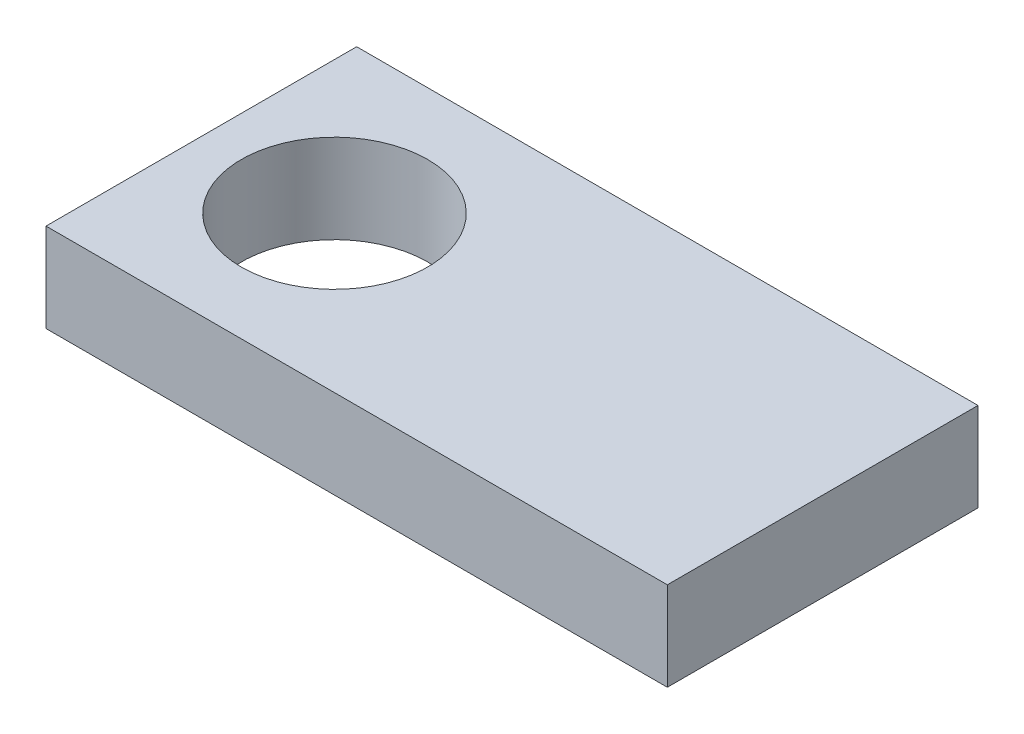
ISO-10303-21;
HEADER;
FILE_DESCRIPTION(('STEP AP214'),'2;1');
FILE_NAME('part.step','',(''),(''),'','','');
FILE_SCHEMA(('AUTOMOTIVE_DESIGN { 1 0 10303 214 1 1 1 1 }'));
ENDSEC;
DATA;
#1=APPLICATION_CONTEXT('core data for automotive mechanical design processes');
#2=APPLICATION_PROTOCOL_DEFINITION('international standard','automotive_design',2000,#1);
#3=PRODUCT_CONTEXT('',#1,'mechanical');
#4=PRODUCT('Part','Part','',(#3));
#5=PRODUCT_RELATED_PRODUCT_CATEGORY('part','',(#4));
#6=PRODUCT_DEFINITION_FORMATION('','',#4);
#7=PRODUCT_DEFINITION_CONTEXT('part definition',#1,'design');
#8=PRODUCT_DEFINITION('design','',#6,#7);
#9=PRODUCT_DEFINITION_SHAPE('','',#8);
#10=(LENGTH_UNIT() NAMED_UNIT(*) SI_UNIT(.MILLI.,.METRE.));
#11=(NAMED_UNIT(*) PLANE_ANGLE_UNIT() SI_UNIT($,.RADIAN.));
#12=(NAMED_UNIT(*) SI_UNIT($,.STERADIAN.) SOLID_ANGLE_UNIT());
#13=UNCERTAINTY_MEASURE_WITH_UNIT(LENGTH_MEASURE(1.E-05),#10,'distance_accuracy_value','');
#14=(GEOMETRIC_REPRESENTATION_CONTEXT(3) GLOBAL_UNCERTAINTY_ASSIGNED_CONTEXT((#13)) GLOBAL_UNIT_ASSIGNED_CONTEXT((#10,
#11,#12)) REPRESENTATION_CONTEXT('',''));
#15=CARTESIAN_POINT('',(0.,0.,0.));
#16=DIRECTION('',(0.,0.,1.));
#17=DIRECTION('',(1.,0.,0.));
#18=AXIS2_PLACEMENT_3D('',#15,#16,#17);
#19=CARTESIAN_POINT('',(0.,0.,70.));
#20=DIRECTION('',(1.,0.,0.));
#21=DIRECTION('',(0.,0.,-1.));
#22=AXIS2_PLACEMENT_3D('',#19,#20,#21);
#23=PLANE('',#22);
#24=DIRECTION('',(0.,-1.,0.));
#25=VECTOR('',#24,1.);
#26=CARTESIAN_POINT('',(0.,0.,0.));
#27=LINE('',#26,#25);
#28=CARTESIAN_POINT('',(0.,20.,0.));
#29=VERTEX_POINT('',#28);
#30=CARTESIAN_POINT('',(0.,0.,0.));
#31=VERTEX_POINT('',#30);
#32=EDGE_CURVE('E68',#29,#31,#27,.T.);
#33=ORIENTED_EDGE('',*,*,#32,.T.);
#34=DIRECTION('',(0.,0.,-1.));
#35=VECTOR('',#34,1.);
#36=CARTESIAN_POINT('',(0.,0.,70.));
#37=LINE('',#36,#35);
#38=CARTESIAN_POINT('',(0.,0.,70.));
#39=VERTEX_POINT('',#38);
#40=EDGE_CURVE('E11',#39,#31,#37,.T.);
#41=ORIENTED_EDGE('',*,*,#40,.F.);
#42=DIRECTION('',(0.,-1.,0.));
#43=VECTOR('',#42,1.);
#44=CARTESIAN_POINT('',(0.,0.,70.));
#45=LINE('',#44,#43);
#46=CARTESIAN_POINT('',(0.,20.,70.));
#47=VERTEX_POINT('',#46);
#48=EDGE_CURVE('E91',#47,#39,#45,.T.);
#49=ORIENTED_EDGE('',*,*,#48,.F.);
#50=DIRECTION('',(0.,0.,-1.));
#51=VECTOR('',#50,1.);
#52=CARTESIAN_POINT('',(0.,20.,70.));
#53=LINE('',#52,#51);
#54=EDGE_CURVE('E80',#47,#29,#53,.T.);
#55=ORIENTED_EDGE('',*,*,#54,.T.);
#56=EDGE_LOOP('',(#33,#41,#49,#55));
#57=FACE_BOUND('',#56,.T.);
#58=ADVANCED_FACE('F24',(#57),#23,.F.);
#59=CARTESIAN_POINT('',(0.,0.,70.));
#60=DIRECTION('',(0.,1.,0.));
#61=DIRECTION('',(0.,0.,1.));
#62=AXIS2_PLACEMENT_3D('',#59,#60,#61);
#63=PLANE('',#62);
#64=CARTESIAN_POINT('',(30.,0.,35.));
#65=DIRECTION('',(0.,1.,0.));
#66=DIRECTION('',(0.,0.,1.));
#67=AXIS2_PLACEMENT_3D('',#64,#65,#66);
#68=CIRCLE('',#67,21.);
#69=CARTESIAN_POINT('',(30.,0.,56.));
#70=VERTEX_POINT('',#69);
#71=EDGE_CURVE('E81',#70,#70,#68,.T.);
#72=ORIENTED_EDGE('',*,*,#71,.T.);
#73=EDGE_LOOP('',(#72));
#74=FACE_BOUND('',#73,.T.);
#75=DIRECTION('',(1.,0.,0.));
#76=VECTOR('',#75,1.);
#77=CARTESIAN_POINT('',(0.,0.,0.));
#78=LINE('',#77,#76);
#79=CARTESIAN_POINT('',(140.,0.,0.));
#80=VERTEX_POINT('',#79);
#81=EDGE_CURVE('E64',#31,#80,#78,.T.);
#82=ORIENTED_EDGE('',*,*,#81,.T.);
#83=DIRECTION('',(0.,0.,-1.));
#84=VECTOR('',#83,1.);
#85=CARTESIAN_POINT('',(140.,0.,70.));
#86=LINE('',#85,#84);
#87=CARTESIAN_POINT('',(140.,0.,70.));
#88=VERTEX_POINT('',#87);
#89=EDGE_CURVE('E31',#88,#80,#86,.T.);
#90=ORIENTED_EDGE('',*,*,#89,.F.);
#91=DIRECTION('',(1.,0.,0.));
#92=VECTOR('',#91,1.);
#93=CARTESIAN_POINT('',(0.,0.,70.));
#94=LINE('',#93,#92);
#95=EDGE_CURVE('E76',#39,#88,#94,.T.);
#96=ORIENTED_EDGE('',*,*,#95,.F.);
#97=ORIENTED_EDGE('',*,*,#40,.T.);
#98=EDGE_LOOP('',(#82,#90,#96,#97));
#99=FACE_BOUND('',#98,.T.);
#100=ADVANCED_FACE('F75',(#74,#99),#63,.F.);
#101=CARTESIAN_POINT('',(140.,0.,70.));
#102=DIRECTION('',(-1.,0.,0.));
#103=DIRECTION('',(0.,0.,1.));
#104=AXIS2_PLACEMENT_3D('',#101,#102,#103);
#105=PLANE('',#104);
#106=DIRECTION('',(0.,1.,0.));
#107=VECTOR('',#106,1.);
#108=CARTESIAN_POINT('',(140.,0.,0.));
#109=LINE('',#108,#107);
#110=CARTESIAN_POINT('',(140.,20.,0.));
#111=VERTEX_POINT('',#110);
#112=EDGE_CURVE('E69',#80,#111,#109,.T.);
#113=ORIENTED_EDGE('',*,*,#112,.T.);
#114=DIRECTION('',(0.,0.,-1.));
#115=VECTOR('',#114,1.);
#116=CARTESIAN_POINT('',(140.,20.,70.));
#117=LINE('',#116,#115);
#118=CARTESIAN_POINT('',(140.,20.,70.));
#119=VERTEX_POINT('',#118);
#120=EDGE_CURVE('E97',#119,#111,#117,.T.);
#121=ORIENTED_EDGE('',*,*,#120,.F.);
#122=DIRECTION('',(0.,1.,0.));
#123=VECTOR('',#122,1.);
#124=CARTESIAN_POINT('',(140.,0.,70.));
#125=LINE('',#124,#123);
#126=EDGE_CURVE('E43',#88,#119,#125,.T.);
#127=ORIENTED_EDGE('',*,*,#126,.F.);
#128=ORIENTED_EDGE('',*,*,#89,.T.);
#129=EDGE_LOOP('',(#113,#121,#127,#128));
#130=FACE_BOUND('',#129,.T.);
#131=ADVANCED_FACE('F100',(#130),#105,.F.);
#132=CARTESIAN_POINT('',(0.,20.,70.));
#133=DIRECTION('',(0.,-1.,0.));
#134=DIRECTION('',(0.,0.,-1.));
#135=AXIS2_PLACEMENT_3D('',#132,#133,#134);
#136=PLANE('',#135);
#137=CARTESIAN_POINT('',(30.,20.,35.));
#138=DIRECTION('',(0.,1.,0.));
#139=DIRECTION('',(0.,0.,1.));
#140=AXIS2_PLACEMENT_3D('',#137,#138,#139);
#141=CIRCLE('',#140,21.);
#142=CARTESIAN_POINT('',(30.,20.,56.));
#143=VERTEX_POINT('',#142);
#144=EDGE_CURVE('E84',#143,#143,#141,.T.);
#145=ORIENTED_EDGE('',*,*,#144,.F.);
#146=EDGE_LOOP('',(#145));
#147=FACE_BOUND('',#146,.T.);
#148=DIRECTION('',(-1.,0.,0.));
#149=VECTOR('',#148,1.);
#150=CARTESIAN_POINT('',(0.,20.,0.));
#151=LINE('',#150,#149);
#152=EDGE_CURVE('E89',#111,#29,#151,.T.);
#153=ORIENTED_EDGE('',*,*,#152,.T.);
#154=ORIENTED_EDGE('',*,*,#54,.F.);
#155=DIRECTION('',(-1.,0.,0.));
#156=VECTOR('',#155,1.);
#157=CARTESIAN_POINT('',(0.,20.,70.));
#158=LINE('',#157,#156);
#159=EDGE_CURVE('E38',#119,#47,#158,.T.);
#160=ORIENTED_EDGE('',*,*,#159,.F.);
#161=ORIENTED_EDGE('',*,*,#120,.T.);
#162=EDGE_LOOP('',(#153,#154,#160,#161));
#163=FACE_BOUND('',#162,.T.);
#164=ADVANCED_FACE('F102',(#147,#163),#136,.F.);
#165=CARTESIAN_POINT('',(0.,20.,70.));
#166=DIRECTION('',(0.,0.,-1.));
#167=DIRECTION('',(-1.,0.,0.));
#168=AXIS2_PLACEMENT_3D('',#165,#166,#167);
#169=PLANE('',#168);
#170=ORIENTED_EDGE('',*,*,#48,.T.);
#171=ORIENTED_EDGE('',*,*,#95,.T.);
#172=ORIENTED_EDGE('',*,*,#126,.T.);
#173=ORIENTED_EDGE('',*,*,#159,.T.);
#174=EDGE_LOOP('',(#170,#171,#172,#173));
#175=FACE_BOUND('',#174,.T.);
#176=ADVANCED_FACE('F103',(#175),#169,.F.);
#177=CARTESIAN_POINT('',(0.,20.,0.));
#178=DIRECTION('',(0.,0.,-1.));
#179=DIRECTION('',(-1.,0.,0.));
#180=AXIS2_PLACEMENT_3D('',#177,#178,#179);
#181=PLANE('',#180);
#182=ORIENTED_EDGE('',*,*,#32,.F.);
#183=ORIENTED_EDGE('',*,*,#152,.F.);
#184=ORIENTED_EDGE('',*,*,#112,.F.);
#185=ORIENTED_EDGE('',*,*,#81,.F.);
#186=EDGE_LOOP('',(#182,#183,#184,#185));
#187=FACE_BOUND('',#186,.T.);
#188=ADVANCED_FACE('F65',(#187),#181,.T.);
#189=CARTESIAN_POINT('',(30.,0.,35.));
#190=DIRECTION('',(0.,1.,0.));
#191=DIRECTION('',(0.,0.,1.));
#192=AXIS2_PLACEMENT_3D('',#189,#190,#191);
#193=CYLINDRICAL_SURFACE('',#192,21.);
#194=ORIENTED_EDGE('',*,*,#71,.F.);
#195=EDGE_LOOP('',(#194));
#196=FACE_BOUND('',#195,.T.);
#197=ORIENTED_EDGE('',*,*,#144,.T.);
#198=EDGE_LOOP('',(#197));
#199=FACE_BOUND('',#198,.T.);
#200=ADVANCED_FACE('F110',(#196,#199),#193,.F.);
#201=CLOSED_SHELL('',(#58,#100,#131,#164,#176,#188,#200));
#202=MANIFOLD_SOLID_BREP('B2',#201);
#203=ADVANCED_BREP_SHAPE_REPRESENTATION('',(#18,#202),#14);
#204=SHAPE_DEFINITION_REPRESENTATION(#9,#203);
ENDSEC;
END-ISO-10303-21;
